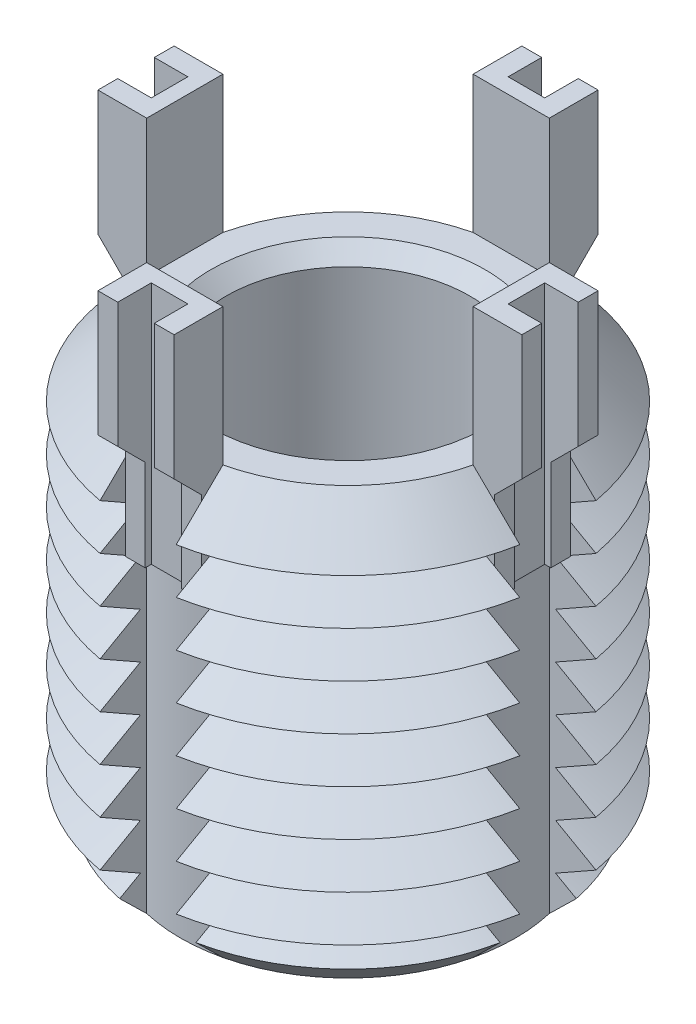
from build123d import *

# Parameters (mm, degrees)
SKETCH1_R               = 7
BOSS_EXTRUDE1_DEPTH     = 14
CHAMFER1_SIZE           = 1.5
LPATTERN1_COUNT         = 8
LPATTERN1_PITCH         = 1.5
CUT_EXTRUDE1_REACH      = 19.146
CIRPATTERN1_COUNT       = 4
BOSS_EXTRUDE3_DEPTH     = 1.25
CIRPATTERN2_COUNT       = 4
CUT_EXTRUDE3_DEPTH      = 21.952896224
CUT_EXTRUDE3_DEPTH_BACK = 21.952896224
SKETCH6_W               = 1.1
SKETCH6_H               = 1.2
SKETCH6_W_2             = 1.2
SKETCH6_H_2             = 1.1
SKETCH7_R               = 4
CUT_EXTRUDE4_DEPTH      = 14
CHAMFER2_SIZE           = 0.5


with BuildPart() as part:
    # Sketch1 → Boss-Extrude1 (new body)
    with BuildSketch(Plane(origin=(0, 0, 0), x_dir=(1, 0, 0), z_dir=(0, 1, 0))):
        with Locations(Location((0, 0, 0), (0, 0, 270))):
            Circle(SKETCH1_R)
    extrude(amount=-BOSS_EXTRUDE1_DEPTH)

    # Chamfer1
    chamfer1_edges = [part.edges().sort_by_distance(p)[0] for p in [
        (0, 0, -7),
        (0, -14, -7),
    ]]
    chamfer(chamfer1_edges, length=CHAMFER1_SIZE)

    # Sketch3 → Cut-Revolve1 (revolve, cut)
    with BuildSketch(Plane(origin=(0, 0, 0), x_dir=(0, 0, -1), z_dir=(1, 0, 0))):
        Polygon((-7, -1.5), (-5.700961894, -2.25), (-7, -3), align=None)
    cut_revolve1 = revolve(axis=Axis((0, 0.885892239, 0), (0, -1, 0)), mode=Mode.SUBTRACT)

    # LPattern1: Cut-Revolve1 ×8
    with Locations(*[(0, -i * LPATTERN1_PITCH, 0) for i in range(1, LPATTERN1_COUNT)]):
        add(cut_revolve1, mode=Mode.SUBTRACT)

    # Cut-Extrude1: up to this cone (the profile starts inside it)
    cut_extrude1_end = Plane(origin=(0, 0, 0), z_dir=(0, 1, 0)).offset(-19.499999) * Cone(1e-06, 58.646, 58.645999, align=(Align.CENTER, Align.CENTER, Align.MIN), mode=Mode.PRIVATE)
    # Sketch4 → Cut-Extrude1 (cut, up to the surface)
    with BuildSketch(Plane(origin=(0, 0, 0), x_dir=(1, 0, 0), z_dir=(0, 1, 0)), mode=Mode.PRIVATE) as cut_extrude1_sk1:
        with BuildLine():
            Line((-5.356071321, 1.25), (-6.887488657, 1.25))
            ThreePointArc((-6.887488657, 1.25), (-7, 0), (-6.887488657, -1.25))
            Line((-6.887488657, -1.25), (-5.356071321, -1.25))
            ThreePointArc((-5.356071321, -1.25), (-5.5, 0), (-5.356071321, 1.25))
        make_face()
    cut_extrude1_tool1 = extrude(cut_extrude1_sk1.sketch, amount=-CUT_EXTRUDE1_REACH, mode=Mode.PRIVATE) & cut_extrude1_end
    cut_extrude1 = cut_extrude1_tool1.solids().sort_by_distance((-6.207212, 0, 0))[0]
    add(cut_extrude1, mode=Mode.SUBTRACT)

    # CirPattern1: Cut-Extrude1 ×4 about axis
    cirpattern1_axis = Axis((0, 0, 0), (0, 1, 0))
    for i in range(1, CIRPATTERN1_COUNT):
        add(cut_extrude1.rotate(cirpattern1_axis, i * 360 / CIRPATTERN1_COUNT), mode=Mode.SUBTRACT)

    # Sketch5 → Boss-Extrude3 (add, symmetric)
    with BuildSketch(Plane(origin=(0, 0, 0), x_dir=(0, 0, -1), z_dir=(1, 0, 0))):
        Polygon((-5.356071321, 4.5), (-5.356071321, -3.5), (-6.056071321, -3.5), (-6.056071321, -0.5), (-6.956071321, 0.4), (-6.956071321, 4.5), align=None)
    boss_extrude3 = extrude(amount=BOSS_EXTRUDE3_DEPTH, both=True)

    # CirPattern2: Boss-Extrude3 ×4 about axis
    cirpattern2_axis = Axis((0, 0, 0), (0, 1, 0))
    for i in range(1, CIRPATTERN2_COUNT):
        add(boss_extrude3.rotate(cirpattern2_axis, i * 360 / CIRPATTERN2_COUNT))

    # Sketch6 → Cut-Extrude3 (cut, two sides: drawn at the far end of the back side and taken through both)
    with BuildSketch(Plane(origin=(0, 4.5, 0), x_dir=(1, 0, 0), z_dir=(0, 1, 0)).offset(-CUT_EXTRUDE3_DEPTH_BACK)):
        with Locations((-6.406071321, 0)):
            Rectangle(SKETCH6_W, SKETCH6_H)
        with Locations((0, 6.406071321)):
            Rectangle(SKETCH6_W_2, SKETCH6_H_2)
        with Locations((6.406071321, 0)):
            Rectangle(SKETCH6_W, SKETCH6_H)
        with Locations((0, -6.406071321)):
            Rectangle(SKETCH6_W_2, SKETCH6_H_2)
    extrude(amount=CUT_EXTRUDE3_DEPTH + CUT_EXTRUDE3_DEPTH_BACK, mode=Mode.SUBTRACT)

    # Sketch7 → Cut-Extrude4 (cut)
    with BuildSketch(Plane(origin=(0, 0, 0), x_dir=(1, 0, 0), z_dir=(0, 1, 0))):
        with Locations(Location((0, 0, 0), (0, 0, 270))):
            Circle(SKETCH7_R)
    extrude(amount=-CUT_EXTRUDE4_DEPTH, mode=Mode.SUBTRACT)

    # Chamfer2
    chamfer2_edges = [part.edges().sort_by_distance(p)[0] for p in [
        (0, 0, -4),
        (0, -14, -4),
    ]]
    chamfer(chamfer2_edges, length=CHAMFER2_SIZE)


solid = part.part
